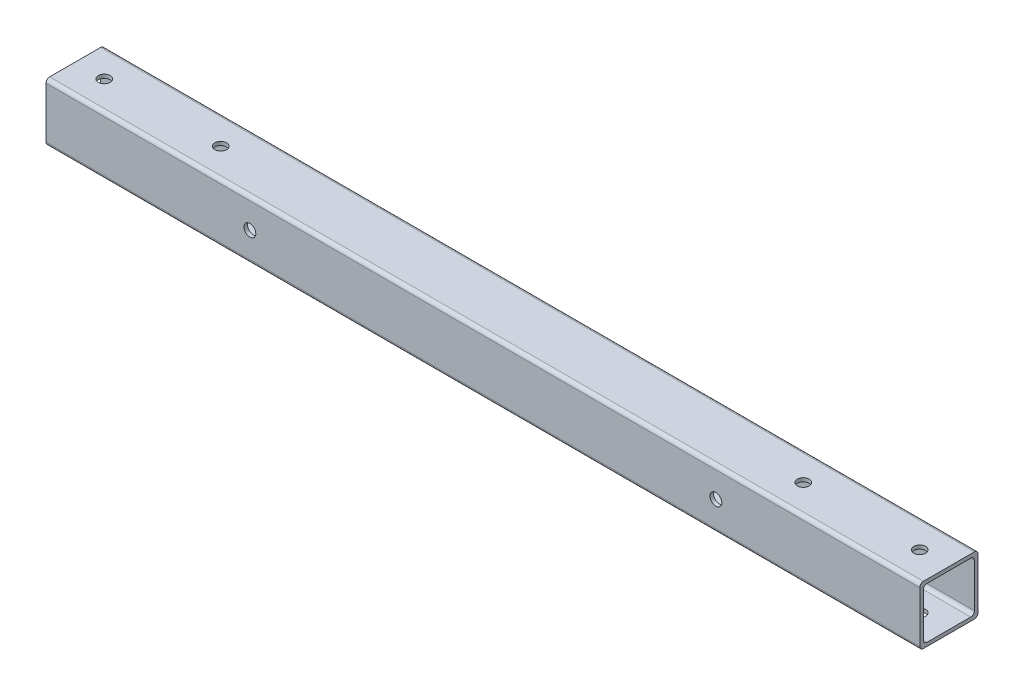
ISO-10303-21;
HEADER;
FILE_DESCRIPTION(('STEP AP214'),'2;1');
FILE_NAME('part.step','',(''),(''),'','','');
FILE_SCHEMA(('AUTOMOTIVE_DESIGN { 1 0 10303 214 1 1 1 1 }'));
ENDSEC;
DATA;
#1=APPLICATION_CONTEXT('core data for automotive mechanical design processes');
#2=APPLICATION_PROTOCOL_DEFINITION('international standard','automotive_design',2000,#1);
#3=PRODUCT_CONTEXT('',#1,'mechanical');
#4=PRODUCT('Part','Part','',(#3));
#5=PRODUCT_RELATED_PRODUCT_CATEGORY('part','',(#4));
#6=PRODUCT_DEFINITION_FORMATION('','',#4);
#7=PRODUCT_DEFINITION_CONTEXT('part definition',#1,'design');
#8=PRODUCT_DEFINITION('design','',#6,#7);
#9=PRODUCT_DEFINITION_SHAPE('','',#8);
#10=(LENGTH_UNIT() NAMED_UNIT(*) SI_UNIT(.MILLI.,.METRE.));
#11=(NAMED_UNIT(*) PLANE_ANGLE_UNIT() SI_UNIT($,.RADIAN.));
#12=(NAMED_UNIT(*) SI_UNIT($,.STERADIAN.) SOLID_ANGLE_UNIT());
#13=UNCERTAINTY_MEASURE_WITH_UNIT(LENGTH_MEASURE(1.E-05),#10,'distance_accuracy_value','');
#14=(GEOMETRIC_REPRESENTATION_CONTEXT(3) GLOBAL_UNCERTAINTY_ASSIGNED_CONTEXT((#13)) GLOBAL_UNIT_ASSIGNED_CONTEXT((#10,
#11,#12)) REPRESENTATION_CONTEXT('',''));
#15=CARTESIAN_POINT('',(0.,0.,0.));
#16=DIRECTION('',(0.,0.,1.));
#17=DIRECTION('',(1.,0.,0.));
#18=AXIS2_PLACEMENT_3D('',#15,#16,#17);
#19=CARTESIAN_POINT('',(0.,101.6,0.));
#20=DIRECTION('',(0.,0.,1.));
#21=DIRECTION('',(1.,0.,0.));
#22=AXIS2_PLACEMENT_3D('',#19,#20,#21);
#23=PLANE('',#22);
#24=DIRECTION('',(0.,-1.,0.));
#25=VECTOR('',#24,1.);
#26=CARTESIAN_POINT('',(-1524.,101.6,1.8663000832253E-13));
#27=LINE('',#26,#25);
#28=CARTESIAN_POINT('',(-1524.,95.25,1.8663000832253E-13));
#29=VERTEX_POINT('',#28);
#30=CARTESIAN_POINT('',(-1524.,6.34999999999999,1.8663000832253E-13));
#31=VERTEX_POINT('',#30);
#32=EDGE_CURVE('E288',#29,#31,#27,.T.);
#33=ORIENTED_EDGE('',*,*,#32,.F.);
#34=DIRECTION('',(-1.,0.,0.));
#35=VECTOR('',#34,1.);
#36=CARTESIAN_POINT('',(0.,95.25,0.));
#37=LINE('',#36,#35);
#38=CARTESIAN_POINT('',(0.,95.25,0.));
#39=VERTEX_POINT('',#38);
#40=EDGE_CURVE('E337',#29,#39,#37,.F.);
#41=ORIENTED_EDGE('',*,*,#40,.T.);
#42=DIRECTION('',(0.,-1.,0.));
#43=VECTOR('',#42,1.);
#44=CARTESIAN_POINT('',(0.,101.6,0.));
#45=LINE('',#44,#43);
#46=CARTESIAN_POINT('',(0.,6.34999999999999,0.));
#47=VERTEX_POINT('',#46);
#48=EDGE_CURVE('E160',#39,#47,#45,.T.);
#49=ORIENTED_EDGE('',*,*,#48,.T.);
#50=DIRECTION('',(-1.,0.,0.));
#51=VECTOR('',#50,1.);
#52=CARTESIAN_POINT('',(-1524.,6.34999999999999,1.8663000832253E-13));
#53=LINE('',#52,#51);
#54=EDGE_CURVE('E335',#47,#31,#53,.T.);
#55=ORIENTED_EDGE('',*,*,#54,.T.);
#56=EDGE_LOOP('',(#33,#41,#49,#55));
#57=FACE_BOUND('',#56,.T.);
#58=CARTESIAN_POINT('',(-1168.4,50.8,0.));
#59=DIRECTION('',(0.,0.,1.));
#60=DIRECTION('',(1.,0.,0.));
#61=AXIS2_PLACEMENT_3D('',#58,#59,#60);
#62=CIRCLE('',#61,10.31875);
#63=CARTESIAN_POINT('',(-1158.08125,50.8,0.));
#64=VERTEX_POINT('',#63);
#65=EDGE_CURVE('E201',#64,#64,#62,.T.);
#66=ORIENTED_EDGE('',*,*,#65,.T.);
#67=EDGE_LOOP('',(#66));
#68=FACE_BOUND('',#67,.T.);
#69=CARTESIAN_POINT('',(-355.6,50.8,0.));
#70=DIRECTION('',(0.,0.,-1.));
#71=DIRECTION('',(-1.,0.,0.));
#72=AXIS2_PLACEMENT_3D('',#69,#70,#71);
#73=CIRCLE('',#72,10.31875);
#74=CARTESIAN_POINT('',(-365.91875,50.8,0.));
#75=VERTEX_POINT('',#74);
#76=EDGE_CURVE('E509',#75,#75,#73,.T.);
#77=ORIENTED_EDGE('',*,*,#76,.F.);
#78=EDGE_LOOP('',(#77));
#79=FACE_BOUND('',#78,.T.);
#80=ADVANCED_FACE('F31',(#57,#68,#79),#23,.F.);
#81=CARTESIAN_POINT('',(0.,101.6,101.6));
#82=DIRECTION('',(0.,0.,-1.));
#83=DIRECTION('',(-1.,0.,0.));
#84=AXIS2_PLACEMENT_3D('',#81,#82,#83);
#85=PLANE('',#84);
#86=DIRECTION('',(0.,-1.,0.));
#87=VECTOR('',#86,1.);
#88=CARTESIAN_POINT('',(-1524.,101.6,101.6));
#89=LINE('',#88,#87);
#90=CARTESIAN_POINT('',(-1524.,95.25,101.6));
#91=VERTEX_POINT('',#90);
#92=CARTESIAN_POINT('',(-1524.,6.34999999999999,101.6));
#93=VERTEX_POINT('',#92);
#94=EDGE_CURVE('E285',#91,#93,#89,.T.);
#95=ORIENTED_EDGE('',*,*,#94,.T.);
#96=DIRECTION('',(1.,0.,0.));
#97=VECTOR('',#96,1.);
#98=CARTESIAN_POINT('',(0.,6.34999999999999,101.6));
#99=LINE('',#98,#97);
#100=CARTESIAN_POINT('',(0.,6.34999999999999,101.6));
#101=VERTEX_POINT('',#100);
#102=EDGE_CURVE('E300',#93,#101,#99,.T.);
#103=ORIENTED_EDGE('',*,*,#102,.T.);
#104=DIRECTION('',(0.,-1.,0.));
#105=VECTOR('',#104,1.);
#106=CARTESIAN_POINT('',(0.,101.6,101.6));
#107=LINE('',#106,#105);
#108=CARTESIAN_POINT('',(0.,95.25,101.6));
#109=VERTEX_POINT('',#108);
#110=EDGE_CURVE('E278',#109,#101,#107,.T.);
#111=ORIENTED_EDGE('',*,*,#110,.F.);
#112=DIRECTION('',(1.,0.,0.));
#113=VECTOR('',#112,1.);
#114=CARTESIAN_POINT('',(0.,95.25,101.6));
#115=LINE('',#114,#113);
#116=EDGE_CURVE('E298',#109,#91,#115,.F.);
#117=ORIENTED_EDGE('',*,*,#116,.T.);
#118=EDGE_LOOP('',(#95,#103,#111,#117));
#119=FACE_BOUND('',#118,.T.);
#120=CARTESIAN_POINT('',(-1168.4,50.8,101.6));
#121=DIRECTION('',(0.,0.,1.));
#122=DIRECTION('',(1.,0.,0.));
#123=AXIS2_PLACEMENT_3D('',#120,#121,#122);
#124=CIRCLE('',#123,10.31875);
#125=CARTESIAN_POINT('',(-1158.08125,50.8,101.6));
#126=VERTEX_POINT('',#125);
#127=EDGE_CURVE('E232',#126,#126,#124,.T.);
#128=ORIENTED_EDGE('',*,*,#127,.F.);
#129=EDGE_LOOP('',(#128));
#130=FACE_BOUND('',#129,.T.);
#131=CARTESIAN_POINT('',(-355.6,50.8,101.6));
#132=DIRECTION('',(0.,0.,-1.));
#133=DIRECTION('',(-1.,0.,0.));
#134=AXIS2_PLACEMENT_3D('',#131,#132,#133);
#135=CIRCLE('',#134,10.31875);
#136=CARTESIAN_POINT('',(-365.91875,50.8,101.6));
#137=VERTEX_POINT('',#136);
#138=EDGE_CURVE('E507',#137,#137,#135,.T.);
#139=ORIENTED_EDGE('',*,*,#138,.T.);
#140=EDGE_LOOP('',(#139));
#141=FACE_BOUND('',#140,.T.);
#142=ADVANCED_FACE('F363',(#119,#130,#141),#85,.F.);
#143=CARTESIAN_POINT('',(0.000999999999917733,95.25,6.35000000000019));
#144=DIRECTION('',(0.,0.,-1.));
#145=DIRECTION('',(0.,1.,0.));
#146=AXIS2_PLACEMENT_3D('',#143,#144,#145);
#147=PLANE('',#146);
#148=DIRECTION('',(0.,1.,0.));
#149=VECTOR('',#148,1.);
#150=CARTESIAN_POINT('',(0.,95.25,6.35000000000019));
#151=LINE('',#150,#149);
#152=CARTESIAN_POINT('',(0.,12.7,6.3500000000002));
#153=VERTEX_POINT('',#152);
#154=CARTESIAN_POINT('',(0.,88.9,6.35000000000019));
#155=VERTEX_POINT('',#154);
#156=EDGE_CURVE('E254',#153,#155,#151,.T.);
#157=ORIENTED_EDGE('',*,*,#156,.T.);
#158=DIRECTION('',(-1.,0.,0.));
#159=VECTOR('',#158,1.);
#160=CARTESIAN_POINT('',(-1524.,88.9,6.35000000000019));
#161=LINE('',#160,#159);
#162=CARTESIAN_POINT('',(-1524.,88.9,6.35000000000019));
#163=VERTEX_POINT('',#162);
#164=EDGE_CURVE('E332',#155,#163,#161,.T.);
#165=ORIENTED_EDGE('',*,*,#164,.T.);
#166=DIRECTION('',(0.,-1.,0.));
#167=VECTOR('',#166,1.);
#168=CARTESIAN_POINT('',(-1524.,95.25,6.35000000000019));
#169=LINE('',#168,#167);
#170=CARTESIAN_POINT('',(-1524.,12.7,6.3500000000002));
#171=VERTEX_POINT('',#170);
#172=EDGE_CURVE('E257',#163,#171,#169,.T.);
#173=ORIENTED_EDGE('',*,*,#172,.T.);
#174=DIRECTION('',(-1.,0.,0.));
#175=VECTOR('',#174,1.);
#176=CARTESIAN_POINT('',(0.,12.7,6.3500000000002));
#177=LINE('',#176,#175);
#178=EDGE_CURVE('E330',#171,#153,#177,.F.);
#179=ORIENTED_EDGE('',*,*,#178,.T.);
#180=EDGE_LOOP('',(#157,#165,#173,#179));
#181=FACE_BOUND('',#180,.T.);
#182=CARTESIAN_POINT('',(-1168.4,50.8,6.3500000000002));
#183=DIRECTION('',(0.,0.,-1.));
#184=DIRECTION('',(0.,1.,0.));
#185=AXIS2_PLACEMENT_3D('',#182,#183,#184);
#186=CIRCLE('',#185,10.31875);
#187=CARTESIAN_POINT('',(-1168.4,61.11875,6.3500000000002));
#188=VERTEX_POINT('',#187);
#189=EDGE_CURVE('E200',#188,#188,#186,.T.);
#190=ORIENTED_EDGE('',*,*,#189,.T.);
#191=EDGE_LOOP('',(#190));
#192=FACE_BOUND('',#191,.T.);
#193=CARTESIAN_POINT('',(-355.6,50.8,6.3500000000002));
#194=DIRECTION('',(0.,0.,-1.));
#195=DIRECTION('',(0.,1.,0.));
#196=AXIS2_PLACEMENT_3D('',#193,#194,#195);
#197=CIRCLE('',#196,10.31875);
#198=CARTESIAN_POINT('',(-355.6,61.11875,6.3500000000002));
#199=VERTEX_POINT('',#198);
#200=EDGE_CURVE('E221',#199,#199,#197,.F.);
#201=ORIENTED_EDGE('',*,*,#200,.F.);
#202=EDGE_LOOP('',(#201));
#203=FACE_BOUND('',#202,.T.);
#204=ADVANCED_FACE('F369',(#181,#192,#203),#147,.F.);
#205=CARTESIAN_POINT('',(0.000999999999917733,95.25,95.2500000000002));
#206=DIRECTION('',(0.,0.,1.));
#207=DIRECTION('',(0.,-1.,0.));
#208=AXIS2_PLACEMENT_3D('',#205,#206,#207);
#209=PLANE('',#208);
#210=DIRECTION('',(0.,-1.,0.));
#211=VECTOR('',#210,1.);
#212=CARTESIAN_POINT('',(0.,95.25,95.2500000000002));
#213=LINE('',#212,#211);
#214=CARTESIAN_POINT('',(0.,88.9,95.2500000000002));
#215=VERTEX_POINT('',#214);
#216=CARTESIAN_POINT('',(0.,12.7,95.2500000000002));
#217=VERTEX_POINT('',#216);
#218=EDGE_CURVE('E153',#215,#217,#213,.T.);
#219=ORIENTED_EDGE('',*,*,#218,.T.);
#220=DIRECTION('',(-1.,0.,0.));
#221=VECTOR('',#220,1.);
#222=CARTESIAN_POINT('',(-1524.,12.7,95.2500000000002));
#223=LINE('',#222,#221);
#224=CARTESIAN_POINT('',(-1524.,12.7,95.2500000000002));
#225=VERTEX_POINT('',#224);
#226=EDGE_CURVE('E159',#217,#225,#223,.T.);
#227=ORIENTED_EDGE('',*,*,#226,.T.);
#228=DIRECTION('',(0.,1.,0.));
#229=VECTOR('',#228,1.);
#230=CARTESIAN_POINT('',(-1524.,95.25,95.2500000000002));
#231=LINE('',#230,#229);
#232=CARTESIAN_POINT('',(-1524.,88.9,95.2500000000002));
#233=VERTEX_POINT('',#232);
#234=EDGE_CURVE('E156',#225,#233,#231,.T.);
#235=ORIENTED_EDGE('',*,*,#234,.T.);
#236=DIRECTION('',(-1.,0.,0.));
#237=VECTOR('',#236,1.);
#238=CARTESIAN_POINT('',(0.,88.9,95.2500000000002));
#239=LINE('',#238,#237);
#240=EDGE_CURVE('E148',#233,#215,#239,.F.);
#241=ORIENTED_EDGE('',*,*,#240,.T.);
#242=EDGE_LOOP('',(#219,#227,#235,#241));
#243=FACE_BOUND('',#242,.T.);
#244=CARTESIAN_POINT('',(-1168.4,50.8,95.2500000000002));
#245=DIRECTION('',(0.,0.,1.));
#246=DIRECTION('',(0.,-1.,0.));
#247=AXIS2_PLACEMENT_3D('',#244,#245,#246);
#248=CIRCLE('',#247,10.31875);
#249=CARTESIAN_POINT('',(-1168.4,40.48125,95.2500000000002));
#250=VERTEX_POINT('',#249);
#251=EDGE_CURVE('E197',#250,#250,#248,.T.);
#252=ORIENTED_EDGE('',*,*,#251,.T.);
#253=EDGE_LOOP('',(#252));
#254=FACE_BOUND('',#253,.T.);
#255=CARTESIAN_POINT('',(-355.6,50.8,95.2500000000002));
#256=DIRECTION('',(0.,0.,1.));
#257=DIRECTION('',(0.,-1.,0.));
#258=AXIS2_PLACEMENT_3D('',#255,#256,#257);
#259=CIRCLE('',#258,10.31875);
#260=CARTESIAN_POINT('',(-355.6,40.48125,95.2500000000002));
#261=VERTEX_POINT('',#260);
#262=EDGE_CURVE('E35',#261,#261,#259,.F.);
#263=ORIENTED_EDGE('',*,*,#262,.F.);
#264=EDGE_LOOP('',(#263));
#265=FACE_BOUND('',#264,.T.);
#266=ADVANCED_FACE('F150',(#243,#254,#265),#209,.F.);
#267=CARTESIAN_POINT('',(0.,101.6,0.));
#268=DIRECTION('',(0.,-1.,0.));
#269=DIRECTION('',(0.,0.,-1.));
#270=AXIS2_PLACEMENT_3D('',#267,#268,#269);
#271=PLANE('',#270);
#272=CARTESIAN_POINT('',(-50.8,101.6,50.8));
#273=DIRECTION('',(0.,1.,0.));
#274=DIRECTION('',(0.,0.,-1.));
#275=AXIS2_PLACEMENT_3D('',#272,#273,#274);
#276=CIRCLE('',#275,10.31875);
#277=CARTESIAN_POINT('',(-50.8,101.6,40.48125));
#278=VERTEX_POINT('',#277);
#279=EDGE_CURVE('E205',#278,#278,#276,.T.);
#280=ORIENTED_EDGE('',*,*,#279,.F.);
#281=EDGE_LOOP('',(#280));
#282=FACE_BOUND('',#281,.T.);
#283=CARTESIAN_POINT('',(-1270.,101.6,50.8));
#284=DIRECTION('',(0.,-1.,0.));
#285=DIRECTION('',(0.,0.,-1.));
#286=AXIS2_PLACEMENT_3D('',#283,#284,#285);
#287=CIRCLE('',#286,10.31875);
#288=CARTESIAN_POINT('',(-1270.,101.6,40.48125));
#289=VERTEX_POINT('',#288);
#290=EDGE_CURVE('E196',#289,#289,#287,.T.);
#291=ORIENTED_EDGE('',*,*,#290,.T.);
#292=EDGE_LOOP('',(#291));
#293=FACE_BOUND('',#292,.T.);
#294=CARTESIAN_POINT('',(-1473.2,101.6,50.8));
#295=DIRECTION('',(0.,-1.,0.));
#296=DIRECTION('',(0.,0.,-1.));
#297=AXIS2_PLACEMENT_3D('',#294,#295,#296);
#298=CIRCLE('',#297,10.31875);
#299=CARTESIAN_POINT('',(-1473.2,101.6,40.48125));
#300=VERTEX_POINT('',#299);
#301=EDGE_CURVE('E191',#300,#300,#298,.T.);
#302=ORIENTED_EDGE('',*,*,#301,.T.);
#303=EDGE_LOOP('',(#302));
#304=FACE_BOUND('',#303,.T.);
#305=DIRECTION('',(0.,0.,1.));
#306=VECTOR('',#305,1.);
#307=CARTESIAN_POINT('',(-1524.,101.6,1.8663000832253E-13));
#308=LINE('',#307,#306);
#309=CARTESIAN_POINT('',(-1524.,101.6,6.35000000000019));
#310=VERTEX_POINT('',#309);
#311=CARTESIAN_POINT('',(-1524.,101.6,95.2500000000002));
#312=VERTEX_POINT('',#311);
#313=EDGE_CURVE('E274',#310,#312,#308,.T.);
#314=ORIENTED_EDGE('',*,*,#313,.T.);
#315=DIRECTION('',(1.,0.,0.));
#316=VECTOR('',#315,1.);
#317=CARTESIAN_POINT('',(0.,101.6,95.25));
#318=LINE('',#317,#316);
#319=CARTESIAN_POINT('',(0.,101.6,95.25));
#320=VERTEX_POINT('',#319);
#321=EDGE_CURVE('E324',#312,#320,#318,.T.);
#322=ORIENTED_EDGE('',*,*,#321,.T.);
#323=DIRECTION('',(0.,0.,-1.));
#324=VECTOR('',#323,1.);
#325=CARTESIAN_POINT('',(0.,101.6,0.));
#326=LINE('',#325,#324);
#327=CARTESIAN_POINT('',(0.,101.6,6.35));
#328=VERTEX_POINT('',#327);
#329=EDGE_CURVE('E271',#320,#328,#326,.T.);
#330=ORIENTED_EDGE('',*,*,#329,.T.);
#331=DIRECTION('',(-1.,0.,0.));
#332=VECTOR('',#331,1.);
#333=CARTESIAN_POINT('',(0.,101.6,6.35));
#334=LINE('',#333,#332);
#335=EDGE_CURVE('E321',#328,#310,#334,.T.);
#336=ORIENTED_EDGE('',*,*,#335,.T.);
#337=EDGE_LOOP('',(#314,#322,#330,#336));
#338=FACE_BOUND('',#337,.T.);
#339=CARTESIAN_POINT('',(-254.,101.6,50.8));
#340=DIRECTION('',(0.,1.,0.));
#341=DIRECTION('',(0.,0.,-1.));
#342=AXIS2_PLACEMENT_3D('',#339,#340,#341);
#343=CIRCLE('',#342,10.31875);
#344=CARTESIAN_POINT('',(-254.,101.6,40.48125));
#345=VERTEX_POINT('',#344);
#346=EDGE_CURVE('E209',#345,#345,#343,.T.);
#347=ORIENTED_EDGE('',*,*,#346,.F.);
#348=EDGE_LOOP('',(#347));
#349=FACE_BOUND('',#348,.T.);
#350=ADVANCED_FACE('F393',(#282,#293,#304,#338,#349),#271,.F.);
#351=CARTESIAN_POINT('',(0.,0.,0.));
#352=DIRECTION('',(0.,-1.,0.));
#353=DIRECTION('',(0.,0.,-1.));
#354=AXIS2_PLACEMENT_3D('',#351,#352,#353);
#355=PLANE('',#354);
#356=CARTESIAN_POINT('',(-50.8,0.,50.8));
#357=DIRECTION('',(0.,1.,0.));
#358=DIRECTION('',(0.,0.,-1.));
#359=AXIS2_PLACEMENT_3D('',#356,#357,#358);
#360=CIRCLE('',#359,10.31875);
#361=CARTESIAN_POINT('',(-50.8,0.,40.48125));
#362=VERTEX_POINT('',#361);
#363=EDGE_CURVE('E213',#362,#362,#360,.T.);
#364=ORIENTED_EDGE('',*,*,#363,.T.);
#365=EDGE_LOOP('',(#364));
#366=FACE_BOUND('',#365,.T.);
#367=CARTESIAN_POINT('',(-1270.,0.,50.8));
#368=DIRECTION('',(0.,-1.,0.));
#369=DIRECTION('',(0.,0.,-1.));
#370=AXIS2_PLACEMENT_3D('',#367,#368,#369);
#371=CIRCLE('',#370,10.31875);
#372=CARTESIAN_POINT('',(-1270.,0.,40.48125));
#373=VERTEX_POINT('',#372);
#374=EDGE_CURVE('E239',#373,#373,#371,.T.);
#375=ORIENTED_EDGE('',*,*,#374,.F.);
#376=EDGE_LOOP('',(#375));
#377=FACE_BOUND('',#376,.T.);
#378=CARTESIAN_POINT('',(-1473.2,0.,50.8));
#379=DIRECTION('',(0.,-1.,0.));
#380=DIRECTION('',(0.,0.,-1.));
#381=AXIS2_PLACEMENT_3D('',#378,#379,#380);
#382=CIRCLE('',#381,10.31875);
#383=CARTESIAN_POINT('',(-1473.2,0.,40.48125));
#384=VERTEX_POINT('',#383);
#385=EDGE_CURVE('E246',#384,#384,#382,.T.);
#386=ORIENTED_EDGE('',*,*,#385,.F.);
#387=EDGE_LOOP('',(#386));
#388=FACE_BOUND('',#387,.T.);
#389=DIRECTION('',(0.,0.,-1.));
#390=VECTOR('',#389,1.);
#391=CARTESIAN_POINT('',(0.,0.,0.));
#392=LINE('',#391,#390);
#393=CARTESIAN_POINT('',(0.,0.,95.25));
#394=VERTEX_POINT('',#393);
#395=CARTESIAN_POINT('',(0.,0.,6.35));
#396=VERTEX_POINT('',#395);
#397=EDGE_CURVE('E270',#394,#396,#392,.T.);
#398=ORIENTED_EDGE('',*,*,#397,.F.);
#399=DIRECTION('',(1.,0.,0.));
#400=VECTOR('',#399,1.);
#401=CARTESIAN_POINT('',(-1524.,0.,95.2500000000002));
#402=LINE('',#401,#400);
#403=CARTESIAN_POINT('',(-1524.,0.,95.2500000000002));
#404=VERTEX_POINT('',#403);
#405=EDGE_CURVE('E313',#394,#404,#402,.F.);
#406=ORIENTED_EDGE('',*,*,#405,.T.);
#407=DIRECTION('',(0.,0.,1.));
#408=VECTOR('',#407,1.);
#409=CARTESIAN_POINT('',(-1524.,0.,1.8663000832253E-13));
#410=LINE('',#409,#408);
#411=CARTESIAN_POINT('',(-1524.,0.,6.35000000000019));
#412=VERTEX_POINT('',#411);
#413=EDGE_CURVE('E275',#412,#404,#410,.T.);
#414=ORIENTED_EDGE('',*,*,#413,.F.);
#415=DIRECTION('',(-1.,0.,0.));
#416=VECTOR('',#415,1.);
#417=CARTESIAN_POINT('',(0.,0.,6.35));
#418=LINE('',#417,#416);
#419=EDGE_CURVE('E311',#412,#396,#418,.F.);
#420=ORIENTED_EDGE('',*,*,#419,.T.);
#421=EDGE_LOOP('',(#398,#406,#414,#420));
#422=FACE_BOUND('',#421,.T.);
#423=CARTESIAN_POINT('',(-254.,0.,50.8));
#424=DIRECTION('',(0.,1.,0.));
#425=DIRECTION('',(0.,0.,-1.));
#426=AXIS2_PLACEMENT_3D('',#423,#424,#425);
#427=CIRCLE('',#426,10.31875);
#428=CARTESIAN_POINT('',(-254.,0.,40.48125));
#429=VERTEX_POINT('',#428);
#430=EDGE_CURVE('E216',#429,#429,#427,.T.);
#431=ORIENTED_EDGE('',*,*,#430,.T.);
#432=EDGE_LOOP('',(#431));
#433=FACE_BOUND('',#432,.T.);
#434=ADVANCED_FACE('F383',(#366,#377,#388,#422,#433),#355,.T.);
#435=CARTESIAN_POINT('',(0.000999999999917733,95.25,6.35000000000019));
#436=DIRECTION('',(0.,1.,0.));
#437=DIRECTION('',(0.,0.,1.));
#438=AXIS2_PLACEMENT_3D('',#435,#436,#437);
#439=PLANE('',#438);
#440=CARTESIAN_POINT('',(-50.8,95.25,50.8));
#441=DIRECTION('',(0.,1.,0.));
#442=DIRECTION('',(0.,0.,1.));
#443=AXIS2_PLACEMENT_3D('',#440,#441,#442);
#444=CIRCLE('',#443,10.31875);
#445=CARTESIAN_POINT('',(-50.8,95.25,61.11875));
#446=VERTEX_POINT('',#445);
#447=EDGE_CURVE('E204',#446,#446,#444,.F.);
#448=ORIENTED_EDGE('',*,*,#447,.F.);
#449=EDGE_LOOP('',(#448));
#450=FACE_BOUND('',#449,.T.);
#451=CARTESIAN_POINT('',(-1270.,95.25,50.8));
#452=DIRECTION('',(0.,1.,0.));
#453=DIRECTION('',(0.,0.,1.));
#454=AXIS2_PLACEMENT_3D('',#451,#452,#453);
#455=CIRCLE('',#454,10.31875);
#456=CARTESIAN_POINT('',(-1270.,95.25,61.11875));
#457=VERTEX_POINT('',#456);
#458=EDGE_CURVE('E195',#457,#457,#455,.T.);
#459=ORIENTED_EDGE('',*,*,#458,.T.);
#460=EDGE_LOOP('',(#459));
#461=FACE_BOUND('',#460,.T.);
#462=CARTESIAN_POINT('',(-1473.2,95.25,50.8));
#463=DIRECTION('',(0.,1.,0.));
#464=DIRECTION('',(0.,0.,1.));
#465=AXIS2_PLACEMENT_3D('',#462,#463,#464);
#466=CIRCLE('',#465,10.31875);
#467=CARTESIAN_POINT('',(-1473.2,95.25,61.11875));
#468=VERTEX_POINT('',#467);
#469=EDGE_CURVE('E172',#468,#468,#466,.T.);
#470=ORIENTED_EDGE('',*,*,#469,.T.);
#471=EDGE_LOOP('',(#470));
#472=FACE_BOUND('',#471,.T.);
#473=DIRECTION('',(0.,0.,1.));
#474=VECTOR('',#473,1.);
#475=CARTESIAN_POINT('',(0.,95.25,6.35000000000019));
#476=LINE('',#475,#474);
#477=CARTESIAN_POINT('',(0.,95.25,12.7000000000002));
#478=VERTEX_POINT('',#477);
#479=CARTESIAN_POINT('',(0.,95.25,88.9000000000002));
#480=VERTEX_POINT('',#479);
#481=EDGE_CURVE('E171',#478,#480,#476,.T.);
#482=ORIENTED_EDGE('',*,*,#481,.T.);
#483=DIRECTION('',(-1.,0.,0.));
#484=VECTOR('',#483,1.);
#485=CARTESIAN_POINT('',(-1524.,95.25,88.9000000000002));
#486=LINE('',#485,#484);
#487=CARTESIAN_POINT('',(-1524.,95.25,88.9000000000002));
#488=VERTEX_POINT('',#487);
#489=EDGE_CURVE('E177',#480,#488,#486,.T.);
#490=ORIENTED_EDGE('',*,*,#489,.T.);
#491=DIRECTION('',(0.,0.,-1.));
#492=VECTOR('',#491,1.);
#493=CARTESIAN_POINT('',(-1524.,95.25,6.35000000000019));
#494=LINE('',#493,#492);
#495=CARTESIAN_POINT('',(-1524.,95.25,12.7000000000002));
#496=VERTEX_POINT('',#495);
#497=EDGE_CURVE('E264',#488,#496,#494,.T.);
#498=ORIENTED_EDGE('',*,*,#497,.T.);
#499=DIRECTION('',(-1.,0.,0.));
#500=VECTOR('',#499,1.);
#501=CARTESIAN_POINT('',(0.,95.25,12.7000000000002));
#502=LINE('',#501,#500);
#503=EDGE_CURVE('E327',#496,#478,#502,.F.);
#504=ORIENTED_EDGE('',*,*,#503,.T.);
#505=EDGE_LOOP('',(#482,#490,#498,#504));
#506=FACE_BOUND('',#505,.T.);
#507=CARTESIAN_POINT('',(-254.,95.25,50.8));
#508=DIRECTION('',(0.,1.,0.));
#509=DIRECTION('',(0.,0.,1.));
#510=AXIS2_PLACEMENT_3D('',#507,#508,#509);
#511=CIRCLE('',#510,10.31875);
#512=CARTESIAN_POINT('',(-254.,95.25,61.11875));
#513=VERTEX_POINT('',#512);
#514=EDGE_CURVE('E208',#513,#513,#511,.F.);
#515=ORIENTED_EDGE('',*,*,#514,.F.);
#516=EDGE_LOOP('',(#515));
#517=FACE_BOUND('',#516,.T.);
#518=ADVANCED_FACE('F377',(#450,#461,#472,#506,#517),#439,.F.);
#519=CARTESIAN_POINT('',(0.000999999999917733,6.35,6.35000000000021));
#520=DIRECTION('',(0.,-1.,0.));
#521=DIRECTION('',(0.,0.,-1.));
#522=AXIS2_PLACEMENT_3D('',#519,#520,#521);
#523=PLANE('',#522);
#524=CARTESIAN_POINT('',(-50.8,6.34999999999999,50.8));
#525=DIRECTION('',(0.,-1.,0.));
#526=DIRECTION('',(0.,0.,-1.));
#527=AXIS2_PLACEMENT_3D('',#524,#525,#526);
#528=CIRCLE('',#527,10.31875);
#529=CARTESIAN_POINT('',(-50.8,6.34999999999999,40.48125));
#530=VERTEX_POINT('',#529);
#531=EDGE_CURVE('E202',#530,#530,#528,.F.);
#532=ORIENTED_EDGE('',*,*,#531,.F.);
#533=EDGE_LOOP('',(#532));
#534=FACE_BOUND('',#533,.T.);
#535=CARTESIAN_POINT('',(-1270.,6.34999999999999,50.8));
#536=DIRECTION('',(0.,-1.,0.));
#537=DIRECTION('',(0.,0.,-1.));
#538=AXIS2_PLACEMENT_3D('',#535,#536,#537);
#539=CIRCLE('',#538,10.31875);
#540=CARTESIAN_POINT('',(-1270.,6.34999999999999,40.48125));
#541=VERTEX_POINT('',#540);
#542=EDGE_CURVE('E192',#541,#541,#539,.T.);
#543=ORIENTED_EDGE('',*,*,#542,.T.);
#544=EDGE_LOOP('',(#543));
#545=FACE_BOUND('',#544,.T.);
#546=CARTESIAN_POINT('',(-1473.2,6.34999999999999,50.8));
#547=DIRECTION('',(0.,-1.,0.));
#548=DIRECTION('',(0.,0.,-1.));
#549=AXIS2_PLACEMENT_3D('',#546,#547,#548);
#550=CIRCLE('',#549,10.31875);
#551=CARTESIAN_POINT('',(-1473.2,6.34999999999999,40.48125));
#552=VERTEX_POINT('',#551);
#553=EDGE_CURVE('E188',#552,#552,#550,.T.);
#554=ORIENTED_EDGE('',*,*,#553,.T.);
#555=EDGE_LOOP('',(#554));
#556=FACE_BOUND('',#555,.T.);
#557=DIRECTION('',(0.,0.,1.));
#558=VECTOR('',#557,1.);
#559=CARTESIAN_POINT('',(-1524.,6.35,6.35000000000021));
#560=LINE('',#559,#558);
#561=CARTESIAN_POINT('',(-1524.,6.35,12.7000000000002));
#562=VERTEX_POINT('',#561);
#563=CARTESIAN_POINT('',(-1524.,6.35,88.9000000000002));
#564=VERTEX_POINT('',#563);
#565=EDGE_CURVE('E260',#562,#564,#560,.T.);
#566=ORIENTED_EDGE('',*,*,#565,.T.);
#567=DIRECTION('',(-1.,0.,0.));
#568=VECTOR('',#567,1.);
#569=CARTESIAN_POINT('',(0.,6.35,88.9000000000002));
#570=LINE('',#569,#568);
#571=CARTESIAN_POINT('',(0.,6.35,88.9000000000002));
#572=VERTEX_POINT('',#571);
#573=EDGE_CURVE('E296',#564,#572,#570,.F.);
#574=ORIENTED_EDGE('',*,*,#573,.T.);
#575=DIRECTION('',(0.,0.,-1.));
#576=VECTOR('',#575,1.);
#577=CARTESIAN_POINT('',(0.,6.35,6.35000000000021));
#578=LINE('',#577,#576);
#579=CARTESIAN_POINT('',(0.,6.35,12.7000000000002));
#580=VERTEX_POINT('',#579);
#581=EDGE_CURVE('E267',#572,#580,#578,.T.);
#582=ORIENTED_EDGE('',*,*,#581,.T.);
#583=DIRECTION('',(-1.,0.,0.));
#584=VECTOR('',#583,1.);
#585=CARTESIAN_POINT('',(-1524.,6.35,12.7000000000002));
#586=LINE('',#585,#584);
#587=EDGE_CURVE('E293',#580,#562,#586,.T.);
#588=ORIENTED_EDGE('',*,*,#587,.T.);
#589=EDGE_LOOP('',(#566,#574,#582,#588));
#590=FACE_BOUND('',#589,.T.);
#591=CARTESIAN_POINT('',(-254.,6.34999999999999,50.8));
#592=DIRECTION('',(0.,-1.,0.));
#593=DIRECTION('',(0.,0.,-1.));
#594=AXIS2_PLACEMENT_3D('',#591,#592,#593);
#595=CIRCLE('',#594,10.31875);
#596=CARTESIAN_POINT('',(-254.,6.34999999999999,40.48125));
#597=VERTEX_POINT('',#596);
#598=EDGE_CURVE('E206',#597,#597,#595,.F.);
#599=ORIENTED_EDGE('',*,*,#598,.F.);
#600=EDGE_LOOP('',(#599));
#601=FACE_BOUND('',#600,.T.);
#602=ADVANCED_FACE('F346',(#534,#545,#556,#590,#601),#523,.F.);
#603=CARTESIAN_POINT('',(0.,101.6,0.));
#604=DIRECTION('',(-1.,0.,0.));
#605=DIRECTION('',(0.,0.,1.));
#606=AXIS2_PLACEMENT_3D('',#603,#604,#605);
#607=PLANE('',#606);
#608=ORIENTED_EDGE('',*,*,#481,.F.);
#609=CARTESIAN_POINT('',(0.,88.9,12.7000000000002));
#610=DIRECTION('',(-1.,0.,0.));
#611=DIRECTION('',(0.,0.,1.));
#612=AXIS2_PLACEMENT_3D('',#609,#610,#611);
#613=CIRCLE('',#612,6.35);
#614=EDGE_CURVE('E181',#478,#155,#613,.T.);
#615=ORIENTED_EDGE('',*,*,#614,.T.);
#616=ORIENTED_EDGE('',*,*,#156,.F.);
#617=CARTESIAN_POINT('',(0.,12.7,12.7000000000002));
#618=DIRECTION('',(-1.,0.,0.));
#619=DIRECTION('',(0.,0.,1.));
#620=AXIS2_PLACEMENT_3D('',#617,#618,#619);
#621=CIRCLE('',#620,6.35);
#622=EDGE_CURVE('E11',#153,#580,#621,.T.);
#623=ORIENTED_EDGE('',*,*,#622,.T.);
#624=ORIENTED_EDGE('',*,*,#581,.F.);
#625=CARTESIAN_POINT('',(0.,12.7,88.9000000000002));
#626=DIRECTION('',(-1.,0.,0.));
#627=DIRECTION('',(0.,0.,1.));
#628=AXIS2_PLACEMENT_3D('',#625,#626,#627);
#629=CIRCLE('',#628,6.35);
#630=EDGE_CURVE('E170',#572,#217,#629,.T.);
#631=ORIENTED_EDGE('',*,*,#630,.T.);
#632=ORIENTED_EDGE('',*,*,#218,.F.);
#633=CARTESIAN_POINT('',(0.,88.9,88.9000000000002));
#634=DIRECTION('',(-1.,0.,0.));
#635=DIRECTION('',(0.,0.,1.));
#636=AXIS2_PLACEMENT_3D('',#633,#634,#635);
#637=CIRCLE('',#636,6.35);
#638=EDGE_CURVE('E166',#215,#480,#637,.T.);
#639=ORIENTED_EDGE('',*,*,#638,.T.);
#640=EDGE_LOOP('',(#608,#615,#616,#623,#624,#631,#632,#639));
#641=FACE_BOUND('',#640,.T.);
#642=ORIENTED_EDGE('',*,*,#110,.T.);
#643=CARTESIAN_POINT('',(0.,6.34999999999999,95.25));
#644=DIRECTION('',(-1.,0.,0.));
#645=DIRECTION('',(0.,0.,1.));
#646=AXIS2_PLACEMENT_3D('',#643,#644,#645);
#647=CIRCLE('',#646,6.35);
#648=EDGE_CURVE('E309',#101,#394,#647,.F.);
#649=ORIENTED_EDGE('',*,*,#648,.T.);
#650=ORIENTED_EDGE('',*,*,#397,.T.);
#651=CARTESIAN_POINT('',(0.,6.34999999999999,6.35));
#652=DIRECTION('',(-1.,0.,0.));
#653=DIRECTION('',(0.,0.,1.));
#654=AXIS2_PLACEMENT_3D('',#651,#652,#653);
#655=CIRCLE('',#654,6.35);
#656=EDGE_CURVE('E303',#396,#47,#655,.F.);
#657=ORIENTED_EDGE('',*,*,#656,.T.);
#658=ORIENTED_EDGE('',*,*,#48,.F.);
#659=CARTESIAN_POINT('',(0.,95.25,6.35));
#660=DIRECTION('',(-1.,0.,0.));
#661=DIRECTION('',(0.,0.,1.));
#662=AXIS2_PLACEMENT_3D('',#659,#660,#661);
#663=CIRCLE('',#662,6.35);
#664=EDGE_CURVE('E305',#39,#328,#663,.F.);
#665=ORIENTED_EDGE('',*,*,#664,.T.);
#666=ORIENTED_EDGE('',*,*,#329,.F.);
#667=CARTESIAN_POINT('',(0.,95.25,95.25));
#668=DIRECTION('',(-1.,0.,0.));
#669=DIRECTION('',(0.,0.,1.));
#670=AXIS2_PLACEMENT_3D('',#667,#668,#669);
#671=CIRCLE('',#670,6.35);
#672=EDGE_CURVE('E307',#320,#109,#671,.F.);
#673=ORIENTED_EDGE('',*,*,#672,.T.);
#674=EDGE_LOOP('',(#642,#649,#650,#657,#658,#665,#666,#673));
#675=FACE_BOUND('',#674,.T.);
#676=ADVANCED_FACE('F164',(#641,#675),#607,.F.);
#677=CARTESIAN_POINT('',(-1524.,101.6,1.8663000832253E-13));
#678=DIRECTION('',(1.,0.,0.));
#679=DIRECTION('',(0.,0.,-1.));
#680=AXIS2_PLACEMENT_3D('',#677,#678,#679);
#681=PLANE('',#680);
#682=ORIENTED_EDGE('',*,*,#565,.F.);
#683=CARTESIAN_POINT('',(-1524.,12.7,12.7000000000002));
#684=DIRECTION('',(1.,0.,0.));
#685=DIRECTION('',(0.,0.,-1.));
#686=AXIS2_PLACEMENT_3D('',#683,#684,#685);
#687=CIRCLE('',#686,6.35);
#688=EDGE_CURVE('E40',#562,#171,#687,.T.);
#689=ORIENTED_EDGE('',*,*,#688,.T.);
#690=ORIENTED_EDGE('',*,*,#172,.F.);
#691=CARTESIAN_POINT('',(-1524.,88.9,12.7000000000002));
#692=DIRECTION('',(1.,0.,0.));
#693=DIRECTION('',(0.,0.,-1.));
#694=AXIS2_PLACEMENT_3D('',#691,#692,#693);
#695=CIRCLE('',#694,6.35);
#696=EDGE_CURVE('E178',#163,#496,#695,.T.);
#697=ORIENTED_EDGE('',*,*,#696,.T.);
#698=ORIENTED_EDGE('',*,*,#497,.F.);
#699=CARTESIAN_POINT('',(-1524.,88.9,88.9000000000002));
#700=DIRECTION('',(1.,0.,0.));
#701=DIRECTION('',(0.,0.,-1.));
#702=AXIS2_PLACEMENT_3D('',#699,#700,#701);
#703=CIRCLE('',#702,6.35);
#704=EDGE_CURVE('E179',#488,#233,#703,.T.);
#705=ORIENTED_EDGE('',*,*,#704,.T.);
#706=ORIENTED_EDGE('',*,*,#234,.F.);
#707=CARTESIAN_POINT('',(-1524.,12.7,88.9000000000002));
#708=DIRECTION('',(1.,0.,0.));
#709=DIRECTION('',(0.,0.,-1.));
#710=AXIS2_PLACEMENT_3D('',#707,#708,#709);
#711=CIRCLE('',#710,6.35);
#712=EDGE_CURVE('E339',#225,#564,#711,.T.);
#713=ORIENTED_EDGE('',*,*,#712,.T.);
#714=EDGE_LOOP('',(#682,#689,#690,#697,#698,#705,#706,#713));
#715=FACE_BOUND('',#714,.T.);
#716=ORIENTED_EDGE('',*,*,#413,.T.);
#717=CARTESIAN_POINT('',(-1524.,6.34999999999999,95.2500000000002));
#718=DIRECTION('',(1.,0.,0.));
#719=DIRECTION('',(0.,0.,-1.));
#720=AXIS2_PLACEMENT_3D('',#717,#718,#719);
#721=CIRCLE('',#720,6.35);
#722=EDGE_CURVE('E319',#404,#93,#721,.F.);
#723=ORIENTED_EDGE('',*,*,#722,.T.);
#724=ORIENTED_EDGE('',*,*,#94,.F.);
#725=CARTESIAN_POINT('',(-1524.,95.25,95.2500000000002));
#726=DIRECTION('',(1.,0.,0.));
#727=DIRECTION('',(0.,0.,-1.));
#728=AXIS2_PLACEMENT_3D('',#725,#726,#727);
#729=CIRCLE('',#728,6.35);
#730=EDGE_CURVE('E317',#91,#312,#729,.F.);
#731=ORIENTED_EDGE('',*,*,#730,.T.);
#732=ORIENTED_EDGE('',*,*,#313,.F.);
#733=CARTESIAN_POINT('',(-1524.,95.25,6.35000000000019));
#734=DIRECTION('',(1.,0.,0.));
#735=DIRECTION('',(0.,0.,-1.));
#736=AXIS2_PLACEMENT_3D('',#733,#734,#735);
#737=CIRCLE('',#736,6.35);
#738=EDGE_CURVE('E56',#310,#29,#737,.F.);
#739=ORIENTED_EDGE('',*,*,#738,.T.);
#740=ORIENTED_EDGE('',*,*,#32,.T.);
#741=CARTESIAN_POINT('',(-1524.,6.34999999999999,6.35000000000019));
#742=DIRECTION('',(1.,0.,0.));
#743=DIRECTION('',(0.,0.,-1.));
#744=AXIS2_PLACEMENT_3D('',#741,#742,#743);
#745=CIRCLE('',#744,6.35);
#746=EDGE_CURVE('E48',#31,#412,#745,.F.);
#747=ORIENTED_EDGE('',*,*,#746,.T.);
#748=EDGE_LOOP('',(#716,#723,#724,#731,#732,#739,#740,#747));
#749=FACE_BOUND('',#748,.T.);
#750=ADVANCED_FACE('F342',(#715,#749),#681,.F.);
#751=CARTESIAN_POINT('',(0.000999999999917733,12.7,88.9000000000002));
#752=DIRECTION('',(1.,0.,0.));
#753=DIRECTION('',(0.,0.,-1.));
#754=AXIS2_PLACEMENT_3D('',#751,#752,#753);
#755=CYLINDRICAL_SURFACE('',#754,6.35);
#756=ORIENTED_EDGE('',*,*,#630,.F.);
#757=ORIENTED_EDGE('',*,*,#573,.F.);
#758=ORIENTED_EDGE('',*,*,#712,.F.);
#759=ORIENTED_EDGE('',*,*,#226,.F.);
#760=EDGE_LOOP('',(#756,#757,#758,#759));
#761=FACE_BOUND('',#760,.T.);
#762=ADVANCED_FACE('F349',(#761),#755,.F.);
#763=CARTESIAN_POINT('',(0.,6.34999999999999,95.25));
#764=DIRECTION('',(-1.,0.,0.));
#765=DIRECTION('',(0.,0.,1.));
#766=AXIS2_PLACEMENT_3D('',#763,#764,#765);
#767=CYLINDRICAL_SURFACE('',#766,6.35);
#768=ORIENTED_EDGE('',*,*,#722,.F.);
#769=ORIENTED_EDGE('',*,*,#405,.F.);
#770=ORIENTED_EDGE('',*,*,#648,.F.);
#771=ORIENTED_EDGE('',*,*,#102,.F.);
#772=EDGE_LOOP('',(#768,#769,#770,#771));
#773=FACE_BOUND('',#772,.T.);
#774=ADVANCED_FACE('F351',(#773),#767,.T.);
#775=CARTESIAN_POINT('',(0.,95.25,95.25));
#776=DIRECTION('',(1.,0.,0.));
#777=DIRECTION('',(0.,0.,-1.));
#778=AXIS2_PLACEMENT_3D('',#775,#776,#777);
#779=CYLINDRICAL_SURFACE('',#778,6.35);
#780=ORIENTED_EDGE('',*,*,#730,.F.);
#781=ORIENTED_EDGE('',*,*,#116,.F.);
#782=ORIENTED_EDGE('',*,*,#672,.F.);
#783=ORIENTED_EDGE('',*,*,#321,.F.);
#784=EDGE_LOOP('',(#780,#781,#782,#783));
#785=FACE_BOUND('',#784,.T.);
#786=ADVANCED_FACE('F357',(#785),#779,.T.);
#787=CARTESIAN_POINT('',(0.000999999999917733,88.9,88.9000000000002));
#788=DIRECTION('',(1.,0.,0.));
#789=DIRECTION('',(0.,0.,-1.));
#790=AXIS2_PLACEMENT_3D('',#787,#788,#789);
#791=CYLINDRICAL_SURFACE('',#790,6.35);
#792=ORIENTED_EDGE('',*,*,#638,.F.);
#793=ORIENTED_EDGE('',*,*,#240,.F.);
#794=ORIENTED_EDGE('',*,*,#704,.F.);
#795=ORIENTED_EDGE('',*,*,#489,.F.);
#796=EDGE_LOOP('',(#792,#793,#794,#795));
#797=FACE_BOUND('',#796,.T.);
#798=ADVANCED_FACE('F175',(#797),#791,.F.);
#799=CARTESIAN_POINT('',(0.000999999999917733,88.9,12.7000000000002));
#800=DIRECTION('',(1.,0.,0.));
#801=DIRECTION('',(0.,0.,-1.));
#802=AXIS2_PLACEMENT_3D('',#799,#800,#801);
#803=CYLINDRICAL_SURFACE('',#802,6.35);
#804=ORIENTED_EDGE('',*,*,#614,.F.);
#805=ORIENTED_EDGE('',*,*,#503,.F.);
#806=ORIENTED_EDGE('',*,*,#696,.F.);
#807=ORIENTED_EDGE('',*,*,#164,.F.);
#808=EDGE_LOOP('',(#804,#805,#806,#807));
#809=FACE_BOUND('',#808,.T.);
#810=ADVANCED_FACE('F462',(#809),#803,.F.);
#811=CARTESIAN_POINT('',(0.,95.25,6.35));
#812=DIRECTION('',(-1.,0.,0.));
#813=DIRECTION('',(0.,0.,1.));
#814=AXIS2_PLACEMENT_3D('',#811,#812,#813);
#815=CYLINDRICAL_SURFACE('',#814,6.35);
#816=ORIENTED_EDGE('',*,*,#664,.F.);
#817=ORIENTED_EDGE('',*,*,#40,.F.);
#818=ORIENTED_EDGE('',*,*,#738,.F.);
#819=ORIENTED_EDGE('',*,*,#335,.F.);
#820=EDGE_LOOP('',(#816,#817,#818,#819));
#821=FACE_BOUND('',#820,.T.);
#822=ADVANCED_FACE('F470',(#821),#815,.T.);
#823=CARTESIAN_POINT('',(0.000999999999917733,12.7,12.7000000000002));
#824=DIRECTION('',(1.,0.,0.));
#825=DIRECTION('',(0.,0.,-1.));
#826=AXIS2_PLACEMENT_3D('',#823,#824,#825);
#827=CYLINDRICAL_SURFACE('',#826,6.35);
#828=ORIENTED_EDGE('',*,*,#622,.F.);
#829=ORIENTED_EDGE('',*,*,#178,.F.);
#830=ORIENTED_EDGE('',*,*,#688,.F.);
#831=ORIENTED_EDGE('',*,*,#587,.F.);
#832=EDGE_LOOP('',(#828,#829,#830,#831));
#833=FACE_BOUND('',#832,.T.);
#834=ADVANCED_FACE('F468',(#833),#827,.F.);
#835=CARTESIAN_POINT('',(0.,6.34999999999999,6.35));
#836=DIRECTION('',(1.,0.,0.));
#837=DIRECTION('',(0.,0.,-1.));
#838=AXIS2_PLACEMENT_3D('',#835,#836,#837);
#839=CYLINDRICAL_SURFACE('',#838,6.35);
#840=ORIENTED_EDGE('',*,*,#656,.F.);
#841=ORIENTED_EDGE('',*,*,#419,.F.);
#842=ORIENTED_EDGE('',*,*,#746,.F.);
#843=ORIENTED_EDGE('',*,*,#54,.F.);
#844=EDGE_LOOP('',(#840,#841,#842,#843));
#845=FACE_BOUND('',#844,.T.);
#846=ADVANCED_FACE('F33',(#845),#839,.T.);
#847=CARTESIAN_POINT('',(-1473.2,101.6,50.8));
#848=DIRECTION('',(0.,-1.,0.));
#849=DIRECTION('',(0.,0.,-1.));
#850=AXIS2_PLACEMENT_3D('',#847,#848,#849);
#851=CYLINDRICAL_SURFACE('',#850,10.31875);
#852=ORIENTED_EDGE('',*,*,#385,.T.);
#853=EDGE_LOOP('',(#852));
#854=FACE_BOUND('',#853,.T.);
#855=ORIENTED_EDGE('',*,*,#553,.F.);
#856=EDGE_LOOP('',(#855));
#857=FACE_BOUND('',#856,.T.);
#858=ADVANCED_FACE('F440',(#854,#857),#851,.F.);
#859=ORIENTED_EDGE('',*,*,#301,.F.);
#860=EDGE_LOOP('',(#859));
#861=FACE_BOUND('',#860,.T.);
#862=ORIENTED_EDGE('',*,*,#469,.F.);
#863=EDGE_LOOP('',(#862));
#864=FACE_BOUND('',#863,.T.);
#865=ADVANCED_FACE('F438',(#861,#864),#851,.F.);
#866=CARTESIAN_POINT('',(-1270.,101.6,50.8));
#867=DIRECTION('',(0.,-1.,0.));
#868=DIRECTION('',(0.,0.,-1.));
#869=AXIS2_PLACEMENT_3D('',#866,#867,#868);
#870=CYLINDRICAL_SURFACE('',#869,10.31875);
#871=ORIENTED_EDGE('',*,*,#374,.T.);
#872=EDGE_LOOP('',(#871));
#873=FACE_BOUND('',#872,.T.);
#874=ORIENTED_EDGE('',*,*,#542,.F.);
#875=EDGE_LOOP('',(#874));
#876=FACE_BOUND('',#875,.T.);
#877=ADVANCED_FACE('F436',(#873,#876),#870,.F.);
#878=ORIENTED_EDGE('',*,*,#290,.F.);
#879=EDGE_LOOP('',(#878));
#880=FACE_BOUND('',#879,.T.);
#881=ORIENTED_EDGE('',*,*,#458,.F.);
#882=EDGE_LOOP('',(#881));
#883=FACE_BOUND('',#882,.T.);
#884=ADVANCED_FACE('F433',(#880,#883),#870,.F.);
#885=CARTESIAN_POINT('',(-1168.4,50.8,0.));
#886=DIRECTION('',(0.,0.,1.));
#887=DIRECTION('',(1.,0.,0.));
#888=AXIS2_PLACEMENT_3D('',#885,#886,#887);
#889=CYLINDRICAL_SURFACE('',#888,10.31875);
#890=ORIENTED_EDGE('',*,*,#127,.T.);
#891=EDGE_LOOP('',(#890));
#892=FACE_BOUND('',#891,.T.);
#893=ORIENTED_EDGE('',*,*,#251,.F.);
#894=EDGE_LOOP('',(#893));
#895=FACE_BOUND('',#894,.T.);
#896=ADVANCED_FACE('F431',(#892,#895),#889,.F.);
#897=ORIENTED_EDGE('',*,*,#65,.F.);
#898=EDGE_LOOP('',(#897));
#899=FACE_BOUND('',#898,.T.);
#900=ORIENTED_EDGE('',*,*,#189,.F.);
#901=EDGE_LOOP('',(#900));
#902=FACE_BOUND('',#901,.T.);
#903=ADVANCED_FACE('F428',(#899,#902),#889,.F.);
#904=CARTESIAN_POINT('',(-50.8,101.6,50.8));
#905=DIRECTION('',(0.,-1.,0.));
#906=DIRECTION('',(0.,0.,-1.));
#907=AXIS2_PLACEMENT_3D('',#904,#905,#906);
#908=CYLINDRICAL_SURFACE('',#907,10.31875);
#909=ORIENTED_EDGE('',*,*,#363,.F.);
#910=EDGE_LOOP('',(#909));
#911=FACE_BOUND('',#910,.T.);
#912=ORIENTED_EDGE('',*,*,#531,.T.);
#913=EDGE_LOOP('',(#912));
#914=FACE_BOUND('',#913,.T.);
#915=ADVANCED_FACE('F422',(#911,#914),#908,.F.);
#916=ORIENTED_EDGE('',*,*,#279,.T.);
#917=EDGE_LOOP('',(#916));
#918=FACE_BOUND('',#917,.T.);
#919=ORIENTED_EDGE('',*,*,#447,.T.);
#920=EDGE_LOOP('',(#919));
#921=FACE_BOUND('',#920,.T.);
#922=ADVANCED_FACE('F415',(#918,#921),#908,.F.);
#923=CARTESIAN_POINT('',(-254.,101.6,50.8));
#924=DIRECTION('',(0.,-1.,0.));
#925=DIRECTION('',(0.,0.,-1.));
#926=AXIS2_PLACEMENT_3D('',#923,#924,#925);
#927=CYLINDRICAL_SURFACE('',#926,10.31875);
#928=ORIENTED_EDGE('',*,*,#430,.F.);
#929=EDGE_LOOP('',(#928));
#930=FACE_BOUND('',#929,.T.);
#931=ORIENTED_EDGE('',*,*,#598,.T.);
#932=EDGE_LOOP('',(#931));
#933=FACE_BOUND('',#932,.T.);
#934=ADVANCED_FACE('F412',(#930,#933),#927,.F.);
#935=ORIENTED_EDGE('',*,*,#346,.T.);
#936=EDGE_LOOP('',(#935));
#937=FACE_BOUND('',#936,.T.);
#938=ORIENTED_EDGE('',*,*,#514,.T.);
#939=EDGE_LOOP('',(#938));
#940=FACE_BOUND('',#939,.T.);
#941=ADVANCED_FACE('F414',(#937,#940),#927,.F.);
#942=CARTESIAN_POINT('',(-355.6,50.8,0.));
#943=DIRECTION('',(0.,0.,1.));
#944=DIRECTION('',(1.,0.,0.));
#945=AXIS2_PLACEMENT_3D('',#942,#943,#944);
#946=CYLINDRICAL_SURFACE('',#945,10.31875);
#947=ORIENTED_EDGE('',*,*,#138,.F.);
#948=EDGE_LOOP('',(#947));
#949=FACE_BOUND('',#948,.T.);
#950=ORIENTED_EDGE('',*,*,#262,.T.);
#951=EDGE_LOOP('',(#950));
#952=FACE_BOUND('',#951,.T.);
#953=ADVANCED_FACE('F421',(#949,#952),#946,.F.);
#954=ORIENTED_EDGE('',*,*,#76,.T.);
#955=EDGE_LOOP('',(#954));
#956=FACE_BOUND('',#955,.T.);
#957=ORIENTED_EDGE('',*,*,#200,.T.);
#958=EDGE_LOOP('',(#957));
#959=FACE_BOUND('',#958,.T.);
#960=ADVANCED_FACE('F426',(#956,#959),#946,.F.);
#961=CLOSED_SHELL('',(#80,#142,#204,#266,#350,#434,#518,#602,#676,#750,#762,#774,#786,#798,#810,
#822,#834,#846,#858,#865,#877,#884,#896,#903,#915,#922,#934,#941,#953,#960));
#962=MANIFOLD_SOLID_BREP('B2',#961);
#963=ADVANCED_BREP_SHAPE_REPRESENTATION('',(#18,#962),#14);
#964=SHAPE_DEFINITION_REPRESENTATION(#9,#963);
ENDSEC;
END-ISO-10303-21;
